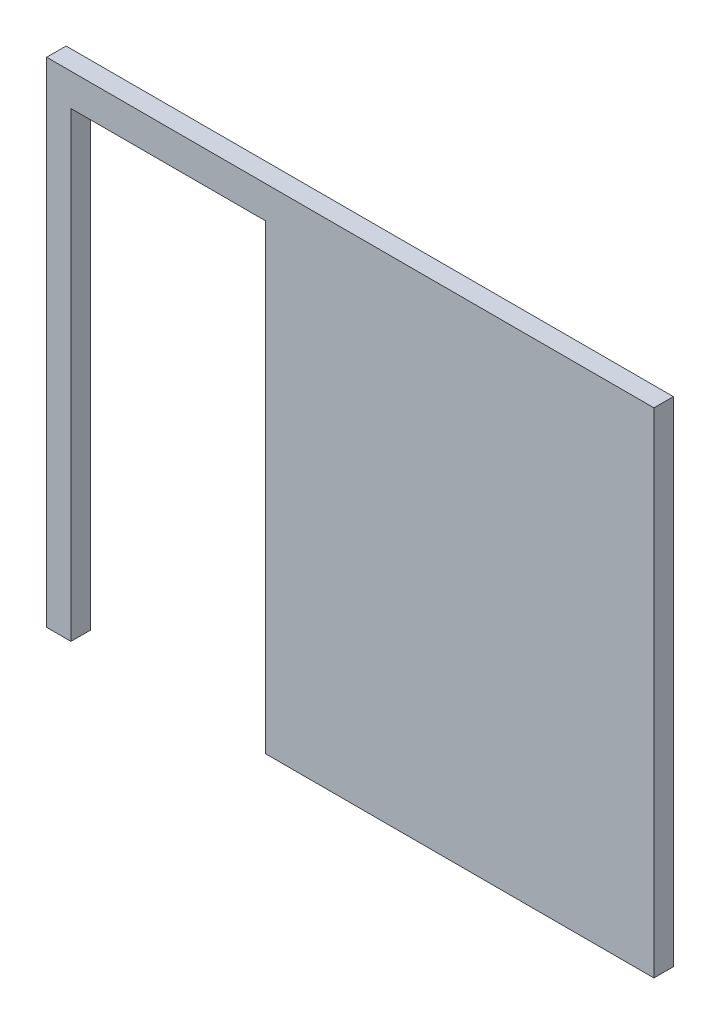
ISO-10303-21;
HEADER;
FILE_DESCRIPTION(('STEP AP214'),'2;1');
FILE_NAME('part.step','',(''),(''),'','','');
FILE_SCHEMA(('AUTOMOTIVE_DESIGN { 1 0 10303 214 1 1 1 1 }'));
ENDSEC;
DATA;
#1=APPLICATION_CONTEXT('core data for automotive mechanical design processes');
#2=APPLICATION_PROTOCOL_DEFINITION('international standard','automotive_design',2000,#1);
#3=PRODUCT_CONTEXT('',#1,'mechanical');
#4=PRODUCT('Part','Part','',(#3));
#5=PRODUCT_RELATED_PRODUCT_CATEGORY('part','',(#4));
#6=PRODUCT_DEFINITION_FORMATION('','',#4);
#7=PRODUCT_DEFINITION_CONTEXT('part definition',#1,'design');
#8=PRODUCT_DEFINITION('design','',#6,#7);
#9=PRODUCT_DEFINITION_SHAPE('','',#8);
#10=(LENGTH_UNIT() NAMED_UNIT(*) SI_UNIT(.MILLI.,.METRE.));
#11=(NAMED_UNIT(*) PLANE_ANGLE_UNIT() SI_UNIT($,.RADIAN.));
#12=(NAMED_UNIT(*) SI_UNIT($,.STERADIAN.) SOLID_ANGLE_UNIT());
#13=UNCERTAINTY_MEASURE_WITH_UNIT(LENGTH_MEASURE(1.E-05),#10,'distance_accuracy_value','');
#14=(GEOMETRIC_REPRESENTATION_CONTEXT(3) GLOBAL_UNCERTAINTY_ASSIGNED_CONTEXT((#13)) GLOBAL_UNIT_ASSIGNED_CONTEXT((#10,
#11,#12)) REPRESENTATION_CONTEXT('',''));
#15=CARTESIAN_POINT('',(0.,0.,0.));
#16=DIRECTION('',(0.,0.,1.));
#17=DIRECTION('',(1.,0.,0.));
#18=AXIS2_PLACEMENT_3D('',#15,#16,#17);
#19=CARTESIAN_POINT('',(2218.48757029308,-1712.21936217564,80.));
#20=DIRECTION('',(-1.,0.,0.));
#21=DIRECTION('',(0.,0.,1.));
#22=AXIS2_PLACEMENT_3D('',#19,#20,#21);
#23=PLANE('',#22);
#24=DIRECTION('',(0.,1.,0.));
#25=VECTOR('',#24,1.);
#26=CARTESIAN_POINT('',(2218.48757029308,-1712.21936217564,0.));
#27=LINE('',#26,#25);
#28=CARTESIAN_POINT('',(2218.48757029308,-1712.21936217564,0.));
#29=VERTEX_POINT('',#28);
#30=CARTESIAN_POINT('',(2218.48757029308,320.590637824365,0.));
#31=VERTEX_POINT('',#30);
#32=EDGE_CURVE('E128',#29,#31,#27,.T.);
#33=ORIENTED_EDGE('',*,*,#32,.T.);
#34=DIRECTION('',(0.,0.,-1.));
#35=VECTOR('',#34,1.);
#36=CARTESIAN_POINT('',(2218.48757029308,320.590637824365,80.));
#37=LINE('',#36,#35);
#38=CARTESIAN_POINT('',(2218.48757029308,320.590637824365,80.));
#39=VERTEX_POINT('',#38);
#40=EDGE_CURVE('E11',#39,#31,#37,.T.);
#41=ORIENTED_EDGE('',*,*,#40,.F.);
#42=DIRECTION('',(0.,1.,0.));
#43=VECTOR('',#42,1.);
#44=CARTESIAN_POINT('',(2218.48757029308,-1712.21936217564,80.));
#45=LINE('',#44,#43);
#46=CARTESIAN_POINT('',(2218.48757029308,-1712.21936217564,80.));
#47=VERTEX_POINT('',#46);
#48=EDGE_CURVE('E142',#47,#39,#45,.T.);
#49=ORIENTED_EDGE('',*,*,#48,.F.);
#50=DIRECTION('',(0.,0.,-1.));
#51=VECTOR('',#50,1.);
#52=CARTESIAN_POINT('',(2218.48757029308,-1712.21936217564,80.));
#53=LINE('',#52,#51);
#54=EDGE_CURVE('E124',#47,#29,#53,.T.);
#55=ORIENTED_EDGE('',*,*,#54,.T.);
#56=EDGE_LOOP('',(#33,#41,#49,#55));
#57=FACE_BOUND('',#56,.T.);
#58=ADVANCED_FACE('F32',(#57),#23,.F.);
#59=CARTESIAN_POINT('',(2218.48757029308,320.590637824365,80.));
#60=DIRECTION('',(0.,-1.,0.));
#61=DIRECTION('',(1.,0.,0.));
#62=AXIS2_PLACEMENT_3D('',#59,#60,#61);
#63=PLANE('',#62);
#64=DIRECTION('',(-1.,0.,0.));
#65=VECTOR('',#64,1.);
#66=CARTESIAN_POINT('',(2218.48757029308,320.590637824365,0.));
#67=LINE('',#66,#65);
#68=CARTESIAN_POINT('',(-281.512429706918,320.590637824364,0.));
#69=VERTEX_POINT('',#68);
#70=EDGE_CURVE('E131',#31,#69,#67,.T.);
#71=ORIENTED_EDGE('',*,*,#70,.T.);
#72=DIRECTION('',(0.,0.,-1.));
#73=VECTOR('',#72,1.);
#74=CARTESIAN_POINT('',(-281.512429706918,320.590637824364,80.));
#75=LINE('',#74,#73);
#76=CARTESIAN_POINT('',(-281.512429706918,320.590637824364,80.));
#77=VERTEX_POINT('',#76);
#78=EDGE_CURVE('E40',#77,#69,#75,.T.);
#79=ORIENTED_EDGE('',*,*,#78,.F.);
#80=DIRECTION('',(-1.,0.,0.));
#81=VECTOR('',#80,1.);
#82=CARTESIAN_POINT('',(2218.48757029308,320.590637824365,80.));
#83=LINE('',#82,#81);
#84=EDGE_CURVE('E91',#39,#77,#83,.T.);
#85=ORIENTED_EDGE('',*,*,#84,.F.);
#86=ORIENTED_EDGE('',*,*,#40,.T.);
#87=EDGE_LOOP('',(#71,#79,#85,#86));
#88=FACE_BOUND('',#87,.T.);
#89=ADVANCED_FACE('F177',(#88),#63,.F.);
#90=CARTESIAN_POINT('',(-281.512429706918,-1712.21936217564,80.));
#91=DIRECTION('',(1.,0.,0.));
#92=DIRECTION('',(0.,0.,-1.));
#93=AXIS2_PLACEMENT_3D('',#90,#91,#92);
#94=PLANE('',#93);
#95=DIRECTION('',(0.,-1.,0.));
#96=VECTOR('',#95,1.);
#97=CARTESIAN_POINT('',(-281.512429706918,-1712.21936217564,0.));
#98=LINE('',#97,#96);
#99=CARTESIAN_POINT('',(-281.512429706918,-1712.21936217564,0.));
#100=VERTEX_POINT('',#99);
#101=EDGE_CURVE('E133',#69,#100,#98,.T.);
#102=ORIENTED_EDGE('',*,*,#101,.T.);
#103=DIRECTION('',(0.,0.,-1.));
#104=VECTOR('',#103,1.);
#105=CARTESIAN_POINT('',(-281.512429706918,-1712.21936217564,80.));
#106=LINE('',#105,#104);
#107=CARTESIAN_POINT('',(-281.512429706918,-1712.21936217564,80.));
#108=VERTEX_POINT('',#107);
#109=EDGE_CURVE('E149',#108,#100,#106,.T.);
#110=ORIENTED_EDGE('',*,*,#109,.F.);
#111=DIRECTION('',(0.,-1.,0.));
#112=VECTOR('',#111,1.);
#113=CARTESIAN_POINT('',(-281.512429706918,-1712.21936217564,80.));
#114=LINE('',#113,#112);
#115=EDGE_CURVE('E157',#77,#108,#114,.T.);
#116=ORIENTED_EDGE('',*,*,#115,.F.);
#117=ORIENTED_EDGE('',*,*,#78,.T.);
#118=EDGE_LOOP('',(#102,#110,#116,#117));
#119=FACE_BOUND('',#118,.T.);
#120=ADVANCED_FACE('F155',(#119),#94,.F.);
#121=CARTESIAN_POINT('',(-181.512429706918,-1712.21936217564,80.));
#122=DIRECTION('',(0.,1.,0.));
#123=DIRECTION('',(0.,0.,1.));
#124=AXIS2_PLACEMENT_3D('',#121,#122,#123);
#125=PLANE('',#124);
#126=DIRECTION('',(1.,0.,0.));
#127=VECTOR('',#126,1.);
#128=CARTESIAN_POINT('',(-181.512429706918,-1712.21936217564,0.));
#129=LINE('',#128,#127);
#130=CARTESIAN_POINT('',(-181.512429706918,-1712.21936217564,0.));
#131=VERTEX_POINT('',#130);
#132=EDGE_CURVE('E135',#100,#131,#129,.T.);
#133=ORIENTED_EDGE('',*,*,#132,.T.);
#134=DIRECTION('',(0.,0.,-1.));
#135=VECTOR('',#134,1.);
#136=CARTESIAN_POINT('',(-181.512429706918,-1712.21936217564,80.));
#137=LINE('',#136,#135);
#138=CARTESIAN_POINT('',(-181.512429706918,-1712.21936217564,80.));
#139=VERTEX_POINT('',#138);
#140=EDGE_CURVE('E146',#139,#131,#137,.T.);
#141=ORIENTED_EDGE('',*,*,#140,.F.);
#142=DIRECTION('',(1.,0.,0.));
#143=VECTOR('',#142,1.);
#144=CARTESIAN_POINT('',(-181.512429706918,-1712.21936217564,80.));
#145=LINE('',#144,#143);
#146=EDGE_CURVE('E169',#108,#139,#145,.T.);
#147=ORIENTED_EDGE('',*,*,#146,.F.);
#148=ORIENTED_EDGE('',*,*,#109,.T.);
#149=EDGE_LOOP('',(#133,#141,#147,#148));
#150=FACE_BOUND('',#149,.T.);
#151=ADVANCED_FACE('F165',(#150),#125,.F.);
#152=CARTESIAN_POINT('',(-181.512429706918,-1712.21936217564,80.));
#153=DIRECTION('',(-1.,0.,0.));
#154=DIRECTION('',(0.,0.,1.));
#155=AXIS2_PLACEMENT_3D('',#152,#153,#154);
#156=PLANE('',#155);
#157=DIRECTION('',(0.,1.,0.));
#158=VECTOR('',#157,1.);
#159=CARTESIAN_POINT('',(-181.512429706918,-1712.21936217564,0.));
#160=LINE('',#159,#158);
#161=CARTESIAN_POINT('',(-181.512429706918,187.780637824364,0.));
#162=VERTEX_POINT('',#161);
#163=EDGE_CURVE('E137',#131,#162,#160,.T.);
#164=ORIENTED_EDGE('',*,*,#163,.T.);
#165=DIRECTION('',(0.,0.,-1.));
#166=VECTOR('',#165,1.);
#167=CARTESIAN_POINT('',(-181.512429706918,187.780637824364,80.));
#168=LINE('',#167,#166);
#169=CARTESIAN_POINT('',(-181.512429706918,187.780637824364,80.));
#170=VERTEX_POINT('',#169);
#171=EDGE_CURVE('E119',#170,#162,#168,.T.);
#172=ORIENTED_EDGE('',*,*,#171,.F.);
#173=DIRECTION('',(0.,1.,0.));
#174=VECTOR('',#173,1.);
#175=CARTESIAN_POINT('',(-181.512429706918,-1712.21936217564,80.));
#176=LINE('',#175,#174);
#177=EDGE_CURVE('E110',#139,#170,#176,.T.);
#178=ORIENTED_EDGE('',*,*,#177,.F.);
#179=ORIENTED_EDGE('',*,*,#140,.T.);
#180=EDGE_LOOP('',(#164,#172,#178,#179));
#181=FACE_BOUND('',#180,.T.);
#182=ADVANCED_FACE('F168',(#181),#156,.F.);
#183=CARTESIAN_POINT('',(-181.512429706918,187.780637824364,80.));
#184=DIRECTION('',(0.,1.,0.));
#185=DIRECTION('',(0.,0.,1.));
#186=AXIS2_PLACEMENT_3D('',#183,#184,#185);
#187=PLANE('',#186);
#188=DIRECTION('',(1.,0.,0.));
#189=VECTOR('',#188,1.);
#190=CARTESIAN_POINT('',(-181.512429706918,187.780637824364,0.));
#191=LINE('',#190,#189);
#192=CARTESIAN_POINT('',(618.487570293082,187.780637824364,0.));
#193=VERTEX_POINT('',#192);
#194=EDGE_CURVE('E118',#162,#193,#191,.T.);
#195=ORIENTED_EDGE('',*,*,#194,.T.);
#196=DIRECTION('',(0.,0.,-1.));
#197=VECTOR('',#196,1.);
#198=CARTESIAN_POINT('',(618.487570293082,187.780637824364,80.));
#199=LINE('',#198,#197);
#200=CARTESIAN_POINT('',(618.487570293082,187.780637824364,80.));
#201=VERTEX_POINT('',#200);
#202=EDGE_CURVE('E115',#201,#193,#199,.T.);
#203=ORIENTED_EDGE('',*,*,#202,.F.);
#204=DIRECTION('',(1.,0.,0.));
#205=VECTOR('',#204,1.);
#206=CARTESIAN_POINT('',(-181.512429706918,187.780637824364,80.));
#207=LINE('',#206,#205);
#208=EDGE_CURVE('E104',#170,#201,#207,.T.);
#209=ORIENTED_EDGE('',*,*,#208,.F.);
#210=ORIENTED_EDGE('',*,*,#171,.T.);
#211=EDGE_LOOP('',(#195,#203,#209,#210));
#212=FACE_BOUND('',#211,.T.);
#213=ADVANCED_FACE('F116',(#212),#187,.F.);
#214=CARTESIAN_POINT('',(618.487570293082,-1712.21936217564,80.));
#215=DIRECTION('',(1.,0.,0.));
#216=DIRECTION('',(0.,0.,-1.));
#217=AXIS2_PLACEMENT_3D('',#214,#215,#216);
#218=PLANE('',#217);
#219=DIRECTION('',(0.,-1.,0.));
#220=VECTOR('',#219,1.);
#221=CARTESIAN_POINT('',(618.487570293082,-1712.21936217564,0.));
#222=LINE('',#221,#220);
#223=CARTESIAN_POINT('',(618.487570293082,-1712.21936217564,0.));
#224=VERTEX_POINT('',#223);
#225=EDGE_CURVE('E77',#193,#224,#222,.T.);
#226=ORIENTED_EDGE('',*,*,#225,.T.);
#227=DIRECTION('',(0.,0.,-1.));
#228=VECTOR('',#227,1.);
#229=CARTESIAN_POINT('',(618.487570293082,-1712.21936217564,80.));
#230=LINE('',#229,#228);
#231=CARTESIAN_POINT('',(618.487570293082,-1712.21936217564,80.));
#232=VERTEX_POINT('',#231);
#233=EDGE_CURVE('E120',#232,#224,#230,.T.);
#234=ORIENTED_EDGE('',*,*,#233,.F.);
#235=DIRECTION('',(0.,-1.,0.));
#236=VECTOR('',#235,1.);
#237=CARTESIAN_POINT('',(618.487570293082,-1712.21936217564,80.));
#238=LINE('',#237,#236);
#239=EDGE_CURVE('E108',#201,#232,#238,.T.);
#240=ORIENTED_EDGE('',*,*,#239,.F.);
#241=ORIENTED_EDGE('',*,*,#202,.T.);
#242=EDGE_LOOP('',(#226,#234,#240,#241));
#243=FACE_BOUND('',#242,.T.);
#244=ADVANCED_FACE('F122',(#243),#218,.F.);
#245=CARTESIAN_POINT('',(2218.48757029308,-1712.21936217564,80.));
#246=DIRECTION('',(0.,1.,0.));
#247=DIRECTION('',(-1.,0.,0.));
#248=AXIS2_PLACEMENT_3D('',#245,#246,#247);
#249=PLANE('',#248);
#250=DIRECTION('',(1.,0.,0.));
#251=VECTOR('',#250,1.);
#252=CARTESIAN_POINT('',(2218.48757029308,-1712.21936217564,0.));
#253=LINE('',#252,#251);
#254=EDGE_CURVE('E83',#224,#29,#253,.T.);
#255=ORIENTED_EDGE('',*,*,#254,.T.);
#256=ORIENTED_EDGE('',*,*,#54,.F.);
#257=DIRECTION('',(1.,0.,0.));
#258=VECTOR('',#257,1.);
#259=CARTESIAN_POINT('',(2218.48757029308,-1712.21936217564,80.));
#260=LINE('',#259,#258);
#261=EDGE_CURVE('E48',#232,#47,#260,.T.);
#262=ORIENTED_EDGE('',*,*,#261,.F.);
#263=ORIENTED_EDGE('',*,*,#233,.T.);
#264=EDGE_LOOP('',(#255,#256,#262,#263));
#265=FACE_BOUND('',#264,.T.);
#266=ADVANCED_FACE('F193',(#265),#249,.F.);
#267=CARTESIAN_POINT('',(0.,0.,80.));
#268=DIRECTION('',(0.,0.,1.));
#269=DIRECTION('',(1.,0.,0.));
#270=AXIS2_PLACEMENT_3D('',#267,#268,#269);
#271=PLANE('',#270);
#272=ORIENTED_EDGE('',*,*,#48,.T.);
#273=ORIENTED_EDGE('',*,*,#84,.T.);
#274=ORIENTED_EDGE('',*,*,#115,.T.);
#275=ORIENTED_EDGE('',*,*,#146,.T.);
#276=ORIENTED_EDGE('',*,*,#177,.T.);
#277=ORIENTED_EDGE('',*,*,#208,.T.);
#278=ORIENTED_EDGE('',*,*,#239,.T.);
#279=ORIENTED_EDGE('',*,*,#261,.T.);
#280=EDGE_LOOP('',(#272,#273,#274,#275,#276,#277,#278,#279));
#281=FACE_BOUND('',#280,.T.);
#282=ADVANCED_FACE('F106',(#281),#271,.T.);
#283=CARTESIAN_POINT('',(0.,0.,0.));
#284=DIRECTION('',(0.,0.,1.));
#285=DIRECTION('',(1.,0.,0.));
#286=AXIS2_PLACEMENT_3D('',#283,#284,#285);
#287=PLANE('',#286);
#288=ORIENTED_EDGE('',*,*,#32,.F.);
#289=ORIENTED_EDGE('',*,*,#254,.F.);
#290=ORIENTED_EDGE('',*,*,#225,.F.);
#291=ORIENTED_EDGE('',*,*,#194,.F.);
#292=ORIENTED_EDGE('',*,*,#163,.F.);
#293=ORIENTED_EDGE('',*,*,#132,.F.);
#294=ORIENTED_EDGE('',*,*,#101,.F.);
#295=ORIENTED_EDGE('',*,*,#70,.F.);
#296=EDGE_LOOP('',(#288,#289,#290,#291,#292,#293,#294,#295));
#297=FACE_BOUND('',#296,.T.);
#298=ADVANCED_FACE('F161',(#297),#287,.F.);
#299=CLOSED_SHELL('',(#58,#89,#120,#151,#182,#213,#244,#266,#282,#298));
#300=MANIFOLD_SOLID_BREP('B2',#299);
#301=ADVANCED_BREP_SHAPE_REPRESENTATION('',(#18,#300),#14);
#302=SHAPE_DEFINITION_REPRESENTATION(#9,#301);
ENDSEC;
END-ISO-10303-21;
